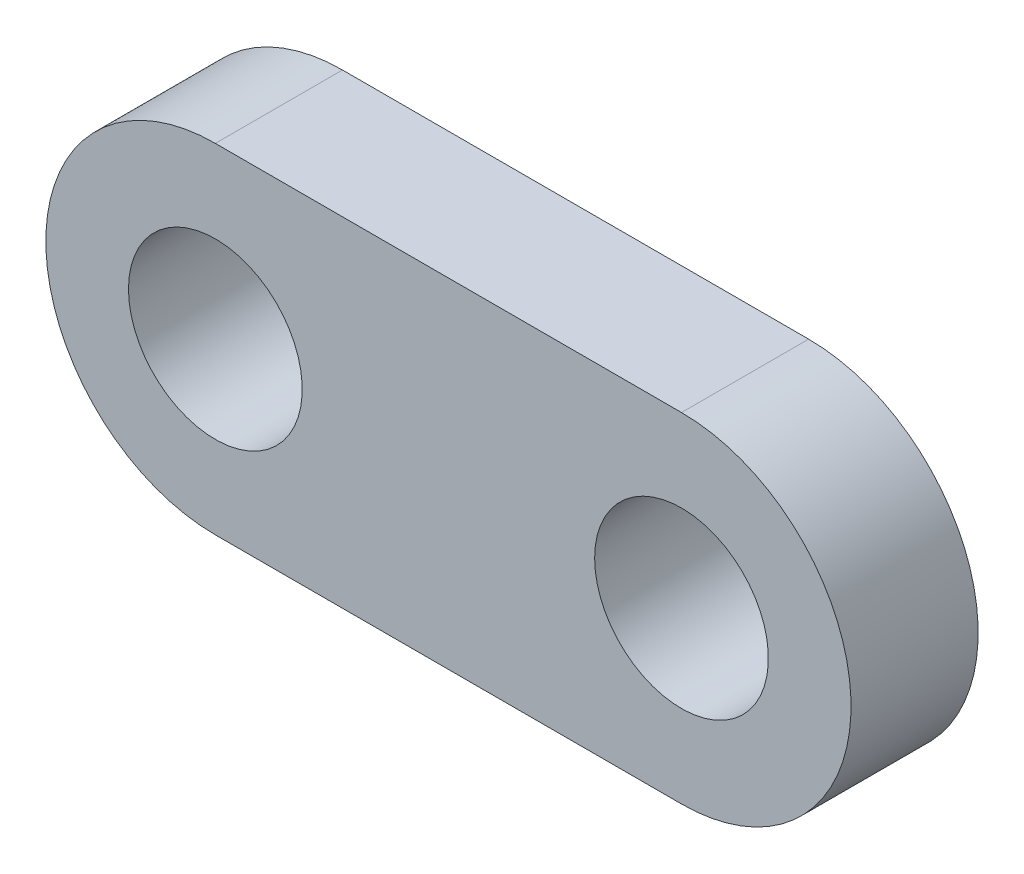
ISO-10303-21;
HEADER;
FILE_DESCRIPTION(('STEP AP214'),'2;1');
FILE_NAME('part.step','',(''),(''),'','','');
FILE_SCHEMA(('AUTOMOTIVE_DESIGN { 1 0 10303 214 1 1 1 1 }'));
ENDSEC;
DATA;
#1=APPLICATION_CONTEXT('core data for automotive mechanical design processes');
#2=APPLICATION_PROTOCOL_DEFINITION('international standard','automotive_design',2000,#1);
#3=PRODUCT_CONTEXT('',#1,'mechanical');
#4=PRODUCT('Part','Part','',(#3));
#5=PRODUCT_RELATED_PRODUCT_CATEGORY('part','',(#4));
#6=PRODUCT_DEFINITION_FORMATION('','',#4);
#7=PRODUCT_DEFINITION_CONTEXT('part definition',#1,'design');
#8=PRODUCT_DEFINITION('design','',#6,#7);
#9=PRODUCT_DEFINITION_SHAPE('','',#8);
#10=(LENGTH_UNIT() NAMED_UNIT(*) SI_UNIT(.MILLI.,.METRE.));
#11=(NAMED_UNIT(*) PLANE_ANGLE_UNIT() SI_UNIT($,.RADIAN.));
#12=(NAMED_UNIT(*) SI_UNIT($,.STERADIAN.) SOLID_ANGLE_UNIT());
#13=UNCERTAINTY_MEASURE_WITH_UNIT(LENGTH_MEASURE(1.E-05),#10,'distance_accuracy_value','');
#14=(GEOMETRIC_REPRESENTATION_CONTEXT(3) GLOBAL_UNCERTAINTY_ASSIGNED_CONTEXT((#13)) GLOBAL_UNIT_ASSIGNED_CONTEXT((#10,
#11,#12)) REPRESENTATION_CONTEXT('',''));
#15=CARTESIAN_POINT('',(0.,0.,0.));
#16=DIRECTION('',(0.,0.,1.));
#17=DIRECTION('',(1.,0.,0.));
#18=AXIS2_PLACEMENT_3D('',#15,#16,#17);
#19=CARTESIAN_POINT('',(22.,0.,0.));
#20=DIRECTION('',(0.,0.,1.));
#21=DIRECTION('',(1.,0.,0.));
#22=AXIS2_PLACEMENT_3D('',#19,#20,#21);
#23=CYLINDRICAL_SURFACE('',#22,8.);
#24=CARTESIAN_POINT('',(22.,0.,6.));
#25=DIRECTION('',(0.,0.,1.));
#26=DIRECTION('',(1.,0.,0.));
#27=AXIS2_PLACEMENT_3D('',#24,#25,#26);
#28=CIRCLE('',#27,8.);
#29=CARTESIAN_POINT('',(22.,-8.,6.));
#30=VERTEX_POINT('',#29);
#31=CARTESIAN_POINT('',(22.,8.,6.));
#32=VERTEX_POINT('',#31);
#33=EDGE_CURVE('E98',#30,#32,#28,.T.);
#34=ORIENTED_EDGE('',*,*,#33,.F.);
#35=DIRECTION('',(0.,0.,1.));
#36=VECTOR('',#35,1.);
#37=CARTESIAN_POINT('',(22.,-8.,0.));
#38=LINE('',#37,#36);
#39=CARTESIAN_POINT('',(22.,-8.,0.));
#40=VERTEX_POINT('',#39);
#41=EDGE_CURVE('E11',#40,#30,#38,.T.);
#42=ORIENTED_EDGE('',*,*,#41,.F.);
#43=CARTESIAN_POINT('',(22.,0.,0.));
#44=DIRECTION('',(0.,0.,1.));
#45=DIRECTION('',(1.,0.,0.));
#46=AXIS2_PLACEMENT_3D('',#43,#44,#45);
#47=CIRCLE('',#46,8.);
#48=CARTESIAN_POINT('',(22.,8.,0.));
#49=VERTEX_POINT('',#48);
#50=EDGE_CURVE('E91',#40,#49,#47,.T.);
#51=ORIENTED_EDGE('',*,*,#50,.T.);
#52=DIRECTION('',(0.,0.,1.));
#53=VECTOR('',#52,1.);
#54=CARTESIAN_POINT('',(22.,8.,0.));
#55=LINE('',#54,#53);
#56=EDGE_CURVE('E36',#49,#32,#55,.T.);
#57=ORIENTED_EDGE('',*,*,#56,.T.);
#58=EDGE_LOOP('',(#34,#42,#51,#57));
#59=FACE_BOUND('',#58,.T.);
#60=ADVANCED_FACE('F33',(#59),#23,.T.);
#61=CARTESIAN_POINT('',(0.,-8.,0.));
#62=DIRECTION('',(0.,-1.,0.));
#63=DIRECTION('',(0.,0.,-1.));
#64=AXIS2_PLACEMENT_3D('',#61,#62,#63);
#65=PLANE('',#64);
#66=DIRECTION('',(1.,0.,0.));
#67=VECTOR('',#66,1.);
#68=CARTESIAN_POINT('',(0.,-8.,6.));
#69=LINE('',#68,#67);
#70=CARTESIAN_POINT('',(0.,-8.,6.));
#71=VERTEX_POINT('',#70);
#72=EDGE_CURVE('E93',#71,#30,#69,.T.);
#73=ORIENTED_EDGE('',*,*,#72,.F.);
#74=DIRECTION('',(0.,0.,1.));
#75=VECTOR('',#74,1.);
#76=CARTESIAN_POINT('',(0.,-8.,0.));
#77=LINE('',#76,#75);
#78=CARTESIAN_POINT('',(0.,-8.,0.));
#79=VERTEX_POINT('',#78);
#80=EDGE_CURVE('E42',#79,#71,#77,.T.);
#81=ORIENTED_EDGE('',*,*,#80,.F.);
#82=DIRECTION('',(1.,0.,0.));
#83=VECTOR('',#82,1.);
#84=CARTESIAN_POINT('',(0.,-8.,0.));
#85=LINE('',#84,#83);
#86=EDGE_CURVE('E88',#79,#40,#85,.T.);
#87=ORIENTED_EDGE('',*,*,#86,.T.);
#88=ORIENTED_EDGE('',*,*,#41,.T.);
#89=EDGE_LOOP('',(#73,#81,#87,#88));
#90=FACE_BOUND('',#89,.T.);
#91=ADVANCED_FACE('F109',(#90),#65,.T.);
#92=CARTESIAN_POINT('',(0.,0.,0.));
#93=DIRECTION('',(0.,0.,1.));
#94=DIRECTION('',(1.,0.,0.));
#95=AXIS2_PLACEMENT_3D('',#92,#93,#94);
#96=CYLINDRICAL_SURFACE('',#95,8.);
#97=CARTESIAN_POINT('',(0.,0.,6.));
#98=DIRECTION('',(0.,0.,1.));
#99=DIRECTION('',(1.,0.,0.));
#100=AXIS2_PLACEMENT_3D('',#97,#98,#99);
#101=CIRCLE('',#100,8.);
#102=CARTESIAN_POINT('',(0.,8.,6.));
#103=VERTEX_POINT('',#102);
#104=EDGE_CURVE('E83',#103,#71,#101,.T.);
#105=ORIENTED_EDGE('',*,*,#104,.F.);
#106=DIRECTION('',(0.,0.,1.));
#107=VECTOR('',#106,1.);
#108=CARTESIAN_POINT('',(0.,8.,0.));
#109=LINE('',#108,#107);
#110=CARTESIAN_POINT('',(0.,8.,0.));
#111=VERTEX_POINT('',#110);
#112=EDGE_CURVE('E78',#111,#103,#109,.T.);
#113=ORIENTED_EDGE('',*,*,#112,.F.);
#114=CARTESIAN_POINT('',(0.,0.,0.));
#115=DIRECTION('',(0.,0.,1.));
#116=DIRECTION('',(1.,0.,0.));
#117=AXIS2_PLACEMENT_3D('',#114,#115,#116);
#118=CIRCLE('',#117,8.);
#119=EDGE_CURVE('E81',#111,#79,#118,.T.);
#120=ORIENTED_EDGE('',*,*,#119,.T.);
#121=ORIENTED_EDGE('',*,*,#80,.T.);
#122=EDGE_LOOP('',(#105,#113,#120,#121));
#123=FACE_BOUND('',#122,.T.);
#124=ADVANCED_FACE('F80',(#123),#96,.T.);
#125=CARTESIAN_POINT('',(22.,8.,0.));
#126=DIRECTION('',(0.,1.,0.));
#127=DIRECTION('',(0.,0.,1.));
#128=AXIS2_PLACEMENT_3D('',#125,#126,#127);
#129=PLANE('',#128);
#130=DIRECTION('',(-1.,0.,0.));
#131=VECTOR('',#130,1.);
#132=CARTESIAN_POINT('',(22.,8.,6.));
#133=LINE('',#132,#131);
#134=EDGE_CURVE('E101',#32,#103,#133,.T.);
#135=ORIENTED_EDGE('',*,*,#134,.F.);
#136=ORIENTED_EDGE('',*,*,#56,.F.);
#137=DIRECTION('',(-1.,0.,0.));
#138=VECTOR('',#137,1.);
#139=CARTESIAN_POINT('',(22.,8.,0.));
#140=LINE('',#139,#138);
#141=EDGE_CURVE('E87',#49,#111,#140,.T.);
#142=ORIENTED_EDGE('',*,*,#141,.T.);
#143=ORIENTED_EDGE('',*,*,#112,.T.);
#144=EDGE_LOOP('',(#135,#136,#142,#143));
#145=FACE_BOUND('',#144,.T.);
#146=ADVANCED_FACE('F90',(#145),#129,.T.);
#147=CARTESIAN_POINT('',(22.,0.,0.));
#148=DIRECTION('',(0.,0.,1.));
#149=DIRECTION('',(1.,0.,0.));
#150=AXIS2_PLACEMENT_3D('',#147,#148,#149);
#151=PLANE('',#150);
#152=CARTESIAN_POINT('',(22.,0.,0.));
#153=DIRECTION('',(0.,0.,1.));
#154=DIRECTION('',(-1.,0.,0.));
#155=AXIS2_PLACEMENT_3D('',#152,#153,#154);
#156=CIRCLE('',#155,4.1);
#157=CARTESIAN_POINT('',(17.9,0.,0.));
#158=VERTEX_POINT('',#157);
#159=EDGE_CURVE('E142',#158,#158,#156,.T.);
#160=ORIENTED_EDGE('',*,*,#159,.T.);
#161=EDGE_LOOP('',(#160));
#162=FACE_BOUND('',#161,.T.);
#163=CARTESIAN_POINT('',(0.,0.,0.));
#164=DIRECTION('',(0.,0.,1.));
#165=DIRECTION('',(-1.,0.,0.));
#166=AXIS2_PLACEMENT_3D('',#163,#164,#165);
#167=CIRCLE('',#166,4.1);
#168=CARTESIAN_POINT('',(-4.1,0.,0.));
#169=VERTEX_POINT('',#168);
#170=EDGE_CURVE('E102',#169,#169,#167,.T.);
#171=ORIENTED_EDGE('',*,*,#170,.T.);
#172=EDGE_LOOP('',(#171));
#173=FACE_BOUND('',#172,.T.);
#174=ORIENTED_EDGE('',*,*,#50,.F.);
#175=ORIENTED_EDGE('',*,*,#86,.F.);
#176=ORIENTED_EDGE('',*,*,#119,.F.);
#177=ORIENTED_EDGE('',*,*,#141,.F.);
#178=EDGE_LOOP('',(#174,#175,#176,#177));
#179=FACE_BOUND('',#178,.T.);
#180=ADVANCED_FACE('F86',(#162,#173,#179),#151,.F.);
#181=CARTESIAN_POINT('',(22.,0.,6.));
#182=DIRECTION('',(0.,0.,1.));
#183=DIRECTION('',(1.,0.,0.));
#184=AXIS2_PLACEMENT_3D('',#181,#182,#183);
#185=PLANE('',#184);
#186=CARTESIAN_POINT('',(22.,0.,6.));
#187=DIRECTION('',(0.,0.,1.));
#188=DIRECTION('',(-1.,0.,0.));
#189=AXIS2_PLACEMENT_3D('',#186,#187,#188);
#190=CIRCLE('',#189,4.1);
#191=CARTESIAN_POINT('',(17.9,0.,6.));
#192=VERTEX_POINT('',#191);
#193=EDGE_CURVE('E145',#192,#192,#190,.T.);
#194=ORIENTED_EDGE('',*,*,#193,.F.);
#195=EDGE_LOOP('',(#194));
#196=FACE_BOUND('',#195,.T.);
#197=CARTESIAN_POINT('',(0.,0.,6.));
#198=DIRECTION('',(0.,0.,1.));
#199=DIRECTION('',(-1.,0.,0.));
#200=AXIS2_PLACEMENT_3D('',#197,#198,#199);
#201=CIRCLE('',#200,4.1);
#202=CARTESIAN_POINT('',(-4.1,0.,6.));
#203=VERTEX_POINT('',#202);
#204=EDGE_CURVE('E147',#203,#203,#201,.T.);
#205=ORIENTED_EDGE('',*,*,#204,.F.);
#206=EDGE_LOOP('',(#205));
#207=FACE_BOUND('',#206,.T.);
#208=ORIENTED_EDGE('',*,*,#33,.T.);
#209=ORIENTED_EDGE('',*,*,#134,.T.);
#210=ORIENTED_EDGE('',*,*,#104,.T.);
#211=ORIENTED_EDGE('',*,*,#72,.T.);
#212=EDGE_LOOP('',(#208,#209,#210,#211));
#213=FACE_BOUND('',#212,.T.);
#214=ADVANCED_FACE('F108',(#196,#207,#213),#185,.T.);
#215=CARTESIAN_POINT('',(0.,0.,0.));
#216=DIRECTION('',(0.,0.,1.));
#217=DIRECTION('',(1.,0.,0.));
#218=AXIS2_PLACEMENT_3D('',#215,#216,#217);
#219=CYLINDRICAL_SURFACE('',#218,4.1);
#220=ORIENTED_EDGE('',*,*,#170,.F.);
#221=EDGE_LOOP('',(#220));
#222=FACE_BOUND('',#221,.T.);
#223=ORIENTED_EDGE('',*,*,#204,.T.);
#224=EDGE_LOOP('',(#223));
#225=FACE_BOUND('',#224,.T.);
#226=ADVANCED_FACE('F127',(#222,#225),#219,.F.);
#227=CARTESIAN_POINT('',(22.,0.,0.));
#228=DIRECTION('',(0.,0.,1.));
#229=DIRECTION('',(1.,0.,0.));
#230=AXIS2_PLACEMENT_3D('',#227,#228,#229);
#231=CYLINDRICAL_SURFACE('',#230,4.1);
#232=ORIENTED_EDGE('',*,*,#159,.F.);
#233=EDGE_LOOP('',(#232));
#234=FACE_BOUND('',#233,.T.);
#235=ORIENTED_EDGE('',*,*,#193,.T.);
#236=EDGE_LOOP('',(#235));
#237=FACE_BOUND('',#236,.T.);
#238=ADVANCED_FACE('F134',(#234,#237),#231,.F.);
#239=CLOSED_SHELL('',(#60,#91,#124,#146,#180,#214,#226,#238));
#240=MANIFOLD_SOLID_BREP('B2',#239);
#241=ADVANCED_BREP_SHAPE_REPRESENTATION('',(#18,#240),#14);
#242=SHAPE_DEFINITION_REPRESENTATION(#9,#241);
ENDSEC;
END-ISO-10303-21;
